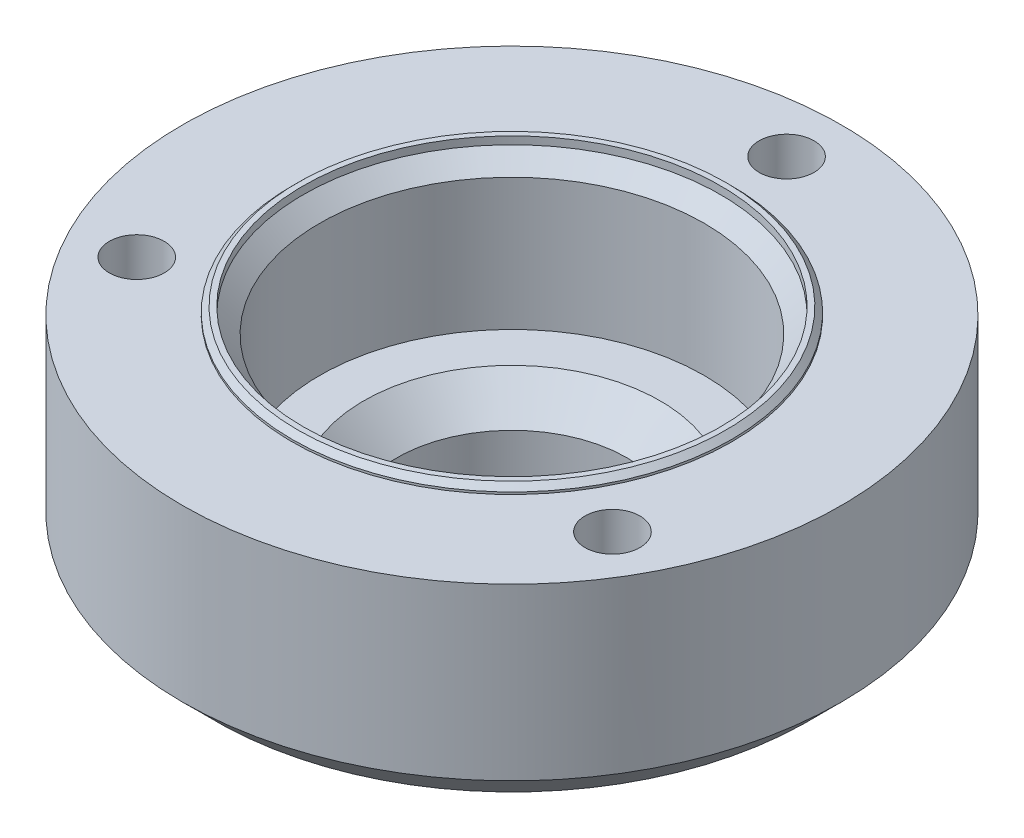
from build123d import *

# Parameters (mm, degrees)
EXTRUSION1_START          = -18
ESQUISSE2_R               = 30
ESQUISSE2_R_2             = 17.5
EXTRUSION1_DEPTH          = 16.5
TROU_TARAUD_M6X1_01_D     = 5
TROU_TARAUD_M6X1_01_DEPTH = 14
TROU_TARAUD_M6X1_01_TIP   = 1.502151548
ESQUISSE5_OUTSIDE_W       = 80
ESQUISSE5_OUTSIDE_H       = 80
ESQUISSE5_OUTSIDE_R       = 12.75
EXTRUSION2_DEPTH          = 12
CHANFREIN1_SIZE           = 1
ESQUISSE6_W               = 69.368847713
ESQUISSE6_H               = 49.218297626
EXTRUSION3_DEPTH          = 8.4
CHANFREIN4_SIZE           = 1.5
ESQUISSE7_R               = 20
ESQUISSE7_R_2             = 11.992707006
EXTRUSION4_DEPTH          = 6
EXTRUSION7_START          = 2
ESQUISSE10_R              = 30
ESQUISSE10_R_2            = 17.622141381
EXTRUSION7_DEPTH          = 2
CHANFREIN5_SIZE           = 3
ESQUISSE11_R              = 20
ESQUISSE11_R_2            = 12.75
EXTRUSION8_DEPTH          = 10
ESQUISSE12_R              = 20
ESQUISSE12_R_2            = 19
EXTRU_MINCE1_DEPTH        = 0.7
CHANFREIN6_SIZE           = 0.5


with BuildPart() as part:
    # Esquisse1 → R_vol.-Mince1 (revolve)
    with BuildSketch(Plane.XY, mode=Mode.PRIVATE) as r_vol_mince1_sk:
        Polygon((17.5, 54.879617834), (17.5, 39.879617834), (10.5, 39.879617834), (10.5, 24.879617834), (13.5, 24.879617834), (13.5, 36.879617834), (20.5, 36.879617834), (20.5, 54.879617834), align=None)
    revolve(r_vol_mince1_sk.sketch.rotate(Axis((0, 0, 0), (0, 1, 0)), 90), axis=Axis((0, 0, 0), (0, 1, 0)))

    # Esquisse2 → Extrusion1 (add)
    with BuildSketch(Plane(origin=(0, 54.879617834, 0), x_dir=(1, 0, 0), z_dir=(0, 1, 0)).offset(EXTRUSION1_START)):
        with Locations(Location((0, 0, 0), (0, 0, 270))):
            Circle(ESQUISSE2_R)
        with Locations(Location((0, 0, 0), (0, 0, 90))):
            Circle(ESQUISSE2_R_2, mode=Mode.SUBTRACT)
    extrude(amount=EXTRUSION1_DEPTH)

    # Trou taraud_ M6x1.01
    with Locations(Plane(origin=(-21.650635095, 53.379617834, 12.5), x_dir=(0, 0, 1), z_dir=(0, 1, 0))):
        with Locations((0, 0), (-37.5, 21.650635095), (0, 43.30127019)):
            Hole(TROU_TARAUD_M6X1_01_D / 2, depth=TROU_TARAUD_M6X1_01_DEPTH)
            with Locations((0, 0, -(TROU_TARAUD_M6X1_01_DEPTH + TROU_TARAUD_M6X1_01_TIP / 2))):  # 118° drill point
                Cone(0, TROU_TARAUD_M6X1_01_D / 2, TROU_TARAUD_M6X1_01_TIP, mode=Mode.SUBTRACT)

    # Esquisse5 outside → Extrusion2 (cut)
    with BuildSketch(Plane.XZ.offset(-24.879617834)):
        Rectangle(ESQUISSE5_OUTSIDE_W, ESQUISSE5_OUTSIDE_H)
        with Locations(Location((0, 0, 0), (0, 0, 270))):
            Circle(ESQUISSE5_OUTSIDE_R, mode=Mode.SUBTRACT)
    extrude(amount=-EXTRUSION2_DEPTH, mode=Mode.SUBTRACT)

    # Chanfrein1
    chanfrein1_edges = [part.edges().sort_by_distance(p)[0] for p in [
        (0, 24.879617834, 12.75),
        (0, 54.879617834, 20.5),
    ]]
    chamfer(chanfrein1_edges, length=CHANFREIN1_SIZE)

    # Esquisse6 → Extrusion3 (cut)
    with BuildSketch(Plane(origin=(0, 53.379617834, 0), x_dir=(1, 0, 0), z_dir=(0, 1, 0))):
        with Locations((-4.574406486, 1.33178923)):
            Rectangle(ESQUISSE6_W, ESQUISSE6_H)
    extrude(amount=EXTRUSION3_DEPTH, mode=Mode.SUBTRACT)

    # Chanfrein4
    chanfrein4_edges = [part.edges().sort_by_distance(p)[0] for p in [
        (0, 53.379617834, 17.5),
    ]]
    chamfer(chanfrein4_edges, length=CHANFREIN4_SIZE)

    # Esquisse7 → Extrusion4 (add)
    with BuildSketch(Plane.XZ.offset(-36.879617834)):
        with Locations(Location((0, 0, 0), (0, 0, 90))):
            Circle(ESQUISSE7_R)
        Circle(ESQUISSE7_R_2, mode=Mode.SUBTRACT)
    extrude(amount=EXTRUSION4_DEPTH)

    # Esquisse10 → Extrusion7 (add)
    with BuildSketch(Plane.XZ.offset(-36.879617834).offset(EXTRUSION7_START)):
        with Locations(Location((0, 0, 0), (0, 0, 90))):
            Circle(ESQUISSE10_R)
        Circle(ESQUISSE10_R_2, mode=Mode.SUBTRACT)
    extrude(amount=-EXTRUSION7_DEPTH)

    # Chanfrein5
    chanfrein5_edges = [part.edges().sort_by_distance(p)[0] for p in [
        (0, 30.879617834, -20),
        (0, 39.879617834, 10.5),
        (0, 34.879617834, -30),
    ]]
    chamfer(chanfrein5_edges, length=CHANFREIN5_SIZE)

    # Esquisse11 → Extrusion8 (cut)
    with BuildSketch(Plane.XZ.offset(-34.879617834)):
        Circle(ESQUISSE11_R)
        with Locations(Location((0, 0, 0), (0, 0, 270))):
            Circle(ESQUISSE11_R_2, mode=Mode.SUBTRACT)
    extrude(amount=EXTRUSION8_DEPTH, mode=Mode.SUBTRACT)

    # Esquisse12 → Extru.-Mince1 (add)
    with BuildSketch(Plane(origin=(0, 53.379617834, 0), x_dir=(1, 0, 0), z_dir=(0, 1, 0))):
        Circle(ESQUISSE12_R)
        Circle(ESQUISSE12_R_2, mode=Mode.SUBTRACT)
    extrude(amount=EXTRU_MINCE1_DEPTH)

    # Chanfrein6
    chanfrein6_edges = [part.edges().sort_by_distance(p)[0] for p in [
        (-20, 54.079617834, 0),
    ]]
    chamfer(chanfrein6_edges, length=CHANFREIN6_SIZE)


solid = part.part
